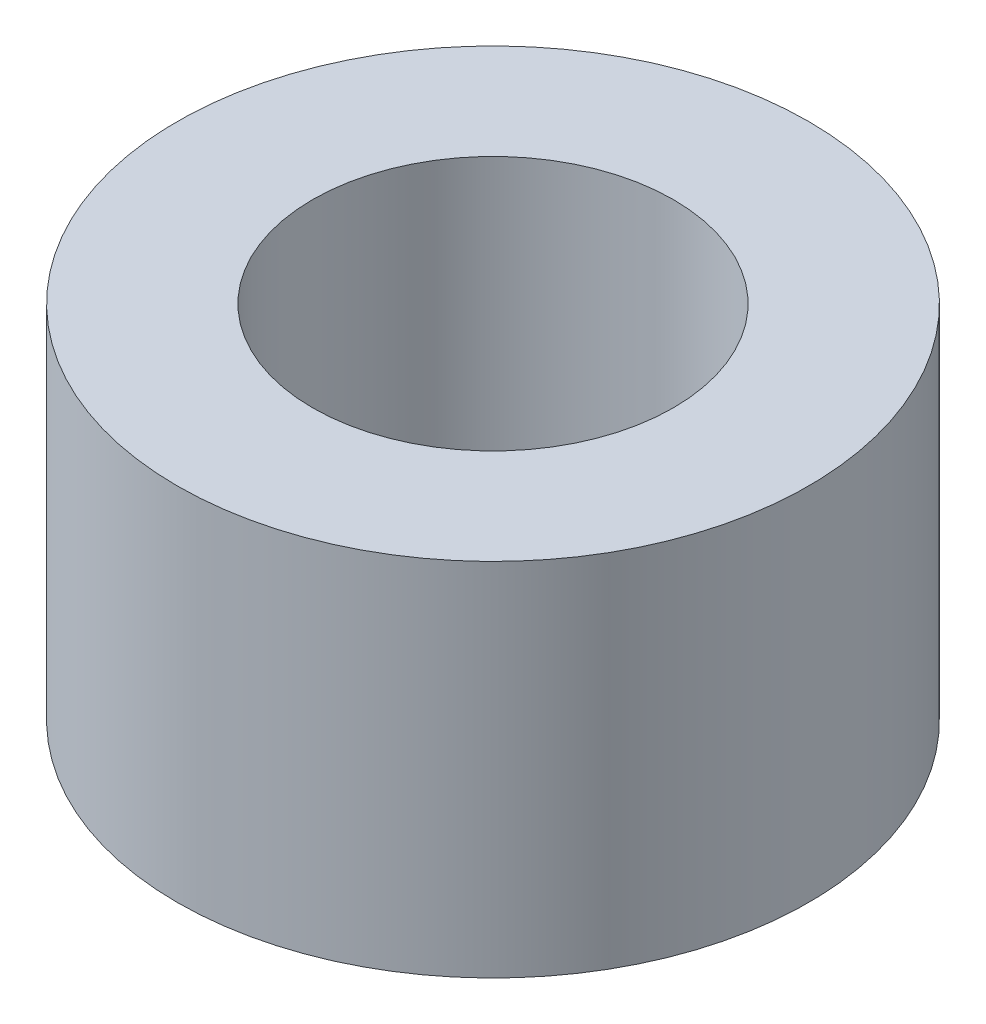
from build123d import *

# Parameters (mm, degrees)
SKETCH_1_R      = 3.5
SKETCH_1_R_2    = 2
EXTRUDE_1_DEPTH = 4


with BuildPart() as part:
    # Sketch 1 → Extrude 1 (new body)
    with BuildSketch(Plane(origin=(0, 0, 0), x_dir=(1, 0, 0), z_dir=(0, 1, 0))):
        with Locations(Location((-9.665060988, 11.514975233, 0), (0, 0, 270))):
            Circle(SKETCH_1_R)
        with Locations(Location((-9.665060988, 11.514975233, 0), (0, 0, 270))):
            Circle(SKETCH_1_R_2, mode=Mode.SUBTRACT)
    extrude(amount=EXTRUDE_1_DEPTH)


solid = part.part
